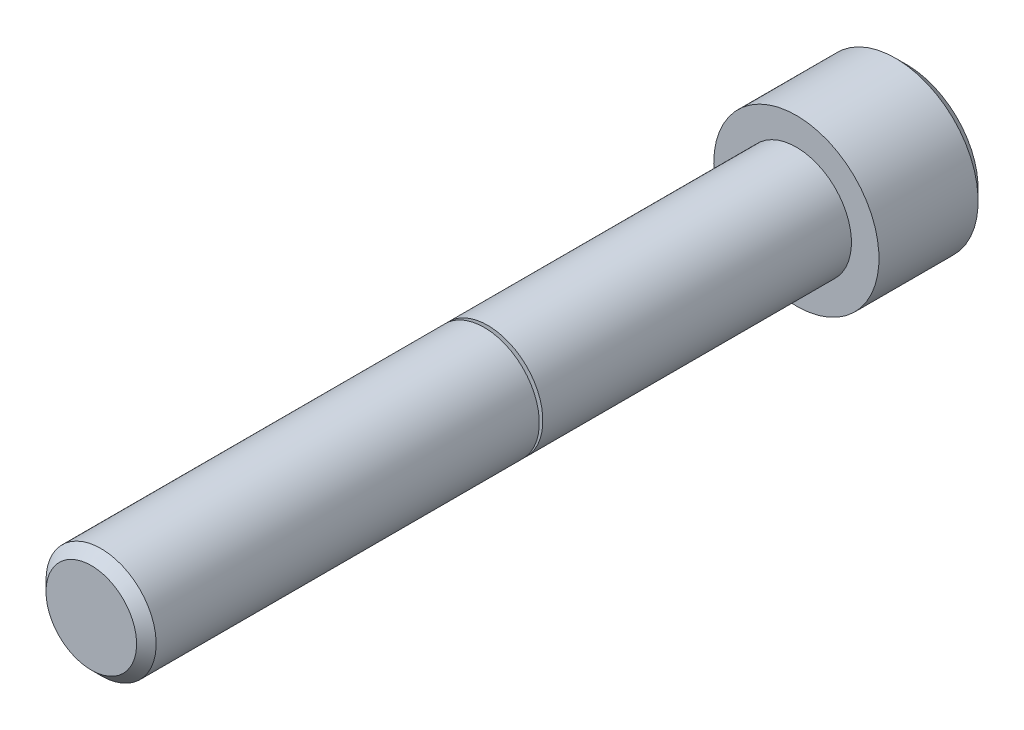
ISO-10303-21;
HEADER;
FILE_DESCRIPTION(('STEP AP214'),'2;1');
FILE_NAME('part.step','',(''),(''),'','','');
FILE_SCHEMA(('AUTOMOTIVE_DESIGN { 1 0 10303 214 1 1 1 1 }'));
ENDSEC;
DATA;
#1=APPLICATION_CONTEXT('core data for automotive mechanical design processes');
#2=APPLICATION_PROTOCOL_DEFINITION('international standard','automotive_design',2000,#1);
#3=PRODUCT_CONTEXT('',#1,'mechanical');
#4=PRODUCT('Part','Part','',(#3));
#5=PRODUCT_RELATED_PRODUCT_CATEGORY('part','',(#4));
#6=PRODUCT_DEFINITION_FORMATION('','',#4);
#7=PRODUCT_DEFINITION_CONTEXT('part definition',#1,'design');
#8=PRODUCT_DEFINITION('design','',#6,#7);
#9=PRODUCT_DEFINITION_SHAPE('','',#8);
#10=(LENGTH_UNIT() NAMED_UNIT(*) SI_UNIT(.MILLI.,.METRE.));
#11=(NAMED_UNIT(*) PLANE_ANGLE_UNIT() SI_UNIT($,.RADIAN.));
#12=(NAMED_UNIT(*) SI_UNIT($,.STERADIAN.) SOLID_ANGLE_UNIT());
#13=UNCERTAINTY_MEASURE_WITH_UNIT(LENGTH_MEASURE(1.E-05),#10,'distance_accuracy_value','');
#14=(GEOMETRIC_REPRESENTATION_CONTEXT(3) GLOBAL_UNCERTAINTY_ASSIGNED_CONTEXT((#13)) GLOBAL_UNIT_ASSIGNED_CONTEXT((#10,
#11,#12)) REPRESENTATION_CONTEXT('',''));
#15=CARTESIAN_POINT('',(0.,0.,0.));
#16=DIRECTION('',(0.,0.,1.));
#17=DIRECTION('',(1.,0.,0.));
#18=AXIS2_PLACEMENT_3D('',#15,#16,#17);
#19=CARTESIAN_POINT('',(0.,0.,-7.93749999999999));
#20=DIRECTION('',(0.,0.,1.));
#21=DIRECTION('',(1.,0.,0.));
#22=AXIS2_PLACEMENT_3D('',#19,#20,#21);
#23=PLANE('',#22);
#24=DIRECTION('',(-0.5,-0.866025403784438,0.));
#25=VECTOR('',#24,1.);
#26=CARTESIAN_POINT('',(3.66617420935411,0.,-7.93749999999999));
#27=LINE('',#26,#25);
#28=CARTESIAN_POINT('',(3.66617420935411,0.,-7.93749999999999));
#29=VERTEX_POINT('',#28);
#30=CARTESIAN_POINT('',(1.83308710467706,-3.17500000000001,-7.93749999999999));
#31=VERTEX_POINT('',#30);
#32=EDGE_CURVE('E145',#29,#31,#27,.T.);
#33=ORIENTED_EDGE('',*,*,#32,.F.);
#34=DIRECTION('',(0.499999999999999,-0.866025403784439,0.));
#35=VECTOR('',#34,1.);
#36=CARTESIAN_POINT('',(1.83308710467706,3.175,-7.93749999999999));
#37=LINE('',#36,#35);
#38=CARTESIAN_POINT('',(1.83308710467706,3.175,-7.93749999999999));
#39=VERTEX_POINT('',#38);
#40=EDGE_CURVE('E64',#39,#29,#37,.T.);
#41=ORIENTED_EDGE('',*,*,#40,.F.);
#42=DIRECTION('',(1.,0.,0.));
#43=VECTOR('',#42,1.);
#44=CARTESIAN_POINT('',(-1.83308710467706,3.175,-7.93749999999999));
#45=LINE('',#44,#43);
#46=CARTESIAN_POINT('',(-1.83308710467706,3.175,-7.93749999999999));
#47=VERTEX_POINT('',#46);
#48=EDGE_CURVE('E158',#47,#39,#45,.T.);
#49=ORIENTED_EDGE('',*,*,#48,.F.);
#50=DIRECTION('',(0.5,0.866025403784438,0.));
#51=VECTOR('',#50,1.);
#52=CARTESIAN_POINT('',(-3.66617420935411,0.,-7.93749999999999));
#53=LINE('',#52,#51);
#54=CARTESIAN_POINT('',(-3.66617420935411,0.,-7.93749999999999));
#55=VERTEX_POINT('',#54);
#56=EDGE_CURVE('E155',#55,#47,#53,.T.);
#57=ORIENTED_EDGE('',*,*,#56,.F.);
#58=DIRECTION('',(-0.5,0.866025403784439,0.));
#59=VECTOR('',#58,1.);
#60=CARTESIAN_POINT('',(-1.83308710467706,-3.17500000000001,-7.93749999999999));
#61=LINE('',#60,#59);
#62=CARTESIAN_POINT('',(-1.83308710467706,-3.17500000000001,-7.93749999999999));
#63=VERTEX_POINT('',#62);
#64=EDGE_CURVE('E112',#63,#55,#61,.T.);
#65=ORIENTED_EDGE('',*,*,#64,.F.);
#66=DIRECTION('',(-1.,0.,0.));
#67=VECTOR('',#66,1.);
#68=CARTESIAN_POINT('',(1.83308710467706,-3.17500000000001,-7.93749999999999));
#69=LINE('',#68,#67);
#70=EDGE_CURVE('E149',#31,#63,#69,.T.);
#71=ORIENTED_EDGE('',*,*,#70,.F.);
#72=EDGE_LOOP('',(#33,#41,#49,#57,#65,#71));
#73=FACE_BOUND('',#72,.T.);
#74=CARTESIAN_POINT('',(0.,0.,-7.93749999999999));
#75=DIRECTION('',(0.,0.,-1.));
#76=DIRECTION('',(-1.,0.,0.));
#77=AXIS2_PLACEMENT_3D('',#74,#75,#76);
#78=CIRCLE('',#77,5.15937500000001);
#79=CARTESIAN_POINT('',(-5.15937500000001,0.,-7.93749999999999));
#80=VERTEX_POINT('',#79);
#81=EDGE_CURVE('E164',#80,#80,#78,.T.);
#82=ORIENTED_EDGE('',*,*,#81,.T.);
#83=EDGE_LOOP('',(#82));
#84=FACE_BOUND('',#83,.T.);
#85=ADVANCED_FACE('F49',(#73,#84),#23,.F.);
#86=CARTESIAN_POINT('',(-3.26390000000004,0.,50.8));
#87=DIRECTION('',(0.,0.,-1.));
#88=DIRECTION('',(-1.,0.,0.));
#89=AXIS2_PLACEMENT_3D('',#86,#87,#88);
#90=PLANE('',#89);
#91=CARTESIAN_POINT('',(0.,0.,50.8));
#92=DIRECTION('',(0.,0.,-1.));
#93=DIRECTION('',(-1.,0.,0.));
#94=AXIS2_PLACEMENT_3D('',#91,#92,#93);
#95=CIRCLE('',#94,3.26390000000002);
#96=CARTESIAN_POINT('',(-3.26390000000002,0.,50.8));
#97=VERTEX_POINT('',#96);
#98=EDGE_CURVE('E11',#97,#97,#95,.T.);
#99=ORIENTED_EDGE('',*,*,#98,.F.);
#100=EDGE_LOOP('',(#99));
#101=FACE_BOUND('',#100,.T.);
#102=ADVANCED_FACE('F214',(#101),#90,.F.);
#103=CARTESIAN_POINT('',(0.,0.,50.8));
#104=DIRECTION('',(0.,0.,-1.));
#105=DIRECTION('',(-1.,0.,0.));
#106=AXIS2_PLACEMENT_3D('',#103,#104,#105);
#107=CONICAL_SURFACE('',#106,3.26390000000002,0.785398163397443);
#108=CARTESIAN_POINT('',(0.,0.,50.09515));
#109=DIRECTION('',(0.,0.,-1.));
#110=DIRECTION('',(-1.,0.,0.));
#111=AXIS2_PLACEMENT_3D('',#108,#109,#110);
#112=CIRCLE('',#111,3.96875000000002);
#113=CARTESIAN_POINT('',(-3.96875000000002,0.,50.09515));
#114=VERTEX_POINT('',#113);
#115=EDGE_CURVE('E57',#114,#114,#112,.T.);
#116=ORIENTED_EDGE('',*,*,#115,.F.);
#117=EDGE_LOOP('',(#116));
#118=FACE_BOUND('',#117,.T.);
#119=ORIENTED_EDGE('',*,*,#98,.T.);
#120=EDGE_LOOP('',(#119));
#121=FACE_BOUND('',#120,.T.);
#122=ADVANCED_FACE('F211',(#118,#121),#107,.T.);
#123=CARTESIAN_POINT('',(0.,0.,-10.585154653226));
#124=DIRECTION('',(0.,0.,-1.));
#125=DIRECTION('',(-1.,0.,0.));
#126=AXIS2_PLACEMENT_3D('',#123,#124,#125);
#127=CYLINDRICAL_SURFACE('',#126,3.96875000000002);
#128=CARTESIAN_POINT('',(0.,0.,22.4915444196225));
#129=DIRECTION('',(0.,0.,-1.));
#130=DIRECTION('',(-1.,0.,0.));
#131=AXIS2_PLACEMENT_3D('',#128,#129,#130);
#132=CIRCLE('',#131,3.96875000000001);
#133=CARTESIAN_POINT('',(-3.96875000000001,0.,22.4915444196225));
#134=VERTEX_POINT('',#133);
#135=EDGE_CURVE('E201',#134,#134,#132,.T.);
#136=ORIENTED_EDGE('',*,*,#135,.F.);
#137=EDGE_LOOP('',(#136));
#138=FACE_BOUND('',#137,.T.);
#139=ORIENTED_EDGE('',*,*,#115,.T.);
#140=EDGE_LOOP('',(#139));
#141=FACE_BOUND('',#140,.T.);
#142=ADVANCED_FACE('F209',(#138,#141),#127,.T.);
#143=CARTESIAN_POINT('',(0.,0.,22.4915444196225));
#144=DIRECTION('',(0.,0.,1.));
#145=DIRECTION('',(1.,0.,0.));
#146=AXIS2_PLACEMENT_3D('',#143,#144,#145);
#147=CONICAL_SURFACE('',#146,3.96875000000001,1.22173047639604);
#148=CARTESIAN_POINT('',(0.,0.,22.2737938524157));
#149=DIRECTION('',(0.,0.,-1.));
#150=DIRECTION('',(-1.,0.,0.));
#151=AXIS2_PLACEMENT_3D('',#148,#149,#150);
#152=CIRCLE('',#151,3.37048523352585);
#153=CARTESIAN_POINT('',(-3.37048523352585,0.,22.2737938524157));
#154=VERTEX_POINT('',#153);
#155=EDGE_CURVE('E197',#154,#154,#152,.T.);
#156=ORIENTED_EDGE('',*,*,#155,.F.);
#157=EDGE_LOOP('',(#156));
#158=FACE_BOUND('',#157,.T.);
#159=ORIENTED_EDGE('',*,*,#135,.T.);
#160=EDGE_LOOP('',(#159));
#161=FACE_BOUND('',#160,.T.);
#162=ADVANCED_FACE('F226',(#158,#161),#147,.T.);
#163=CARTESIAN_POINT('',(0.,0.,22.255));
#164=DIRECTION('',(0.,0.,-1.));
#165=DIRECTION('',(-1.,0.,0.));
#166=AXIS2_PLACEMENT_3D('',#163,#164,#165);
#167=TOROIDAL_SURFACE('',#166,3.37732563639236,0.0200000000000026);
#168=CARTESIAN_POINT('',(0.,0.,22.235));
#169=DIRECTION('',(0.,0.,-1.));
#170=DIRECTION('',(-1.,0.,0.));
#171=AXIS2_PLACEMENT_3D('',#168,#169,#170);
#172=CIRCLE('',#171,3.37732563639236);
#173=CARTESIAN_POINT('',(-3.37732563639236,0.,22.235));
#174=VERTEX_POINT('',#173);
#175=EDGE_CURVE('E193',#174,#174,#172,.T.);
#176=ORIENTED_EDGE('',*,*,#175,.F.);
#177=EDGE_LOOP('',(#176));
#178=FACE_BOUND('',#177,.T.);
#179=ORIENTED_EDGE('',*,*,#155,.T.);
#180=EDGE_LOOP('',(#179));
#181=FACE_BOUND('',#180,.T.);
#182=ADVANCED_FACE('F230',(#178,#181),#167,.F.);
#183=CARTESIAN_POINT('',(-3.96875000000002,0.,22.235));
#184=DIRECTION('',(0.,0.,-1.));
#185=DIRECTION('',(-1.,0.,0.));
#186=AXIS2_PLACEMENT_3D('',#183,#184,#185);
#187=PLANE('',#186);
#188=CARTESIAN_POINT('',(0.,0.,22.235));
#189=DIRECTION('',(0.,0.,-1.));
#190=DIRECTION('',(-1.,0.,0.));
#191=AXIS2_PLACEMENT_3D('',#188,#189,#190);
#192=CIRCLE('',#191,3.96875000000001);
#193=CARTESIAN_POINT('',(-3.96875000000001,0.,22.235));
#194=VERTEX_POINT('',#193);
#195=EDGE_CURVE('E189',#194,#194,#192,.T.);
#196=ORIENTED_EDGE('',*,*,#195,.F.);
#197=EDGE_LOOP('',(#196));
#198=FACE_BOUND('',#197,.T.);
#199=ORIENTED_EDGE('',*,*,#175,.T.);
#200=EDGE_LOOP('',(#199));
#201=FACE_BOUND('',#200,.T.);
#202=ADVANCED_FACE('F234',(#198,#201),#187,.F.);
#203=CARTESIAN_POINT('',(0.,0.,-10.585154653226));
#204=DIRECTION('',(0.,0.,-1.));
#205=DIRECTION('',(-1.,0.,0.));
#206=AXIS2_PLACEMENT_3D('',#203,#204,#205);
#207=CYLINDRICAL_SURFACE('',#206,3.96875000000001);
#208=CARTESIAN_POINT('',(0.,0.,0.));
#209=DIRECTION('',(0.,0.,-1.));
#210=DIRECTION('',(-1.,0.,0.));
#211=AXIS2_PLACEMENT_3D('',#208,#209,#210);
#212=CIRCLE('',#211,3.96875);
#213=CARTESIAN_POINT('',(-3.96875,0.,0.));
#214=VERTEX_POINT('',#213);
#215=EDGE_CURVE('E185',#214,#214,#212,.T.);
#216=ORIENTED_EDGE('',*,*,#215,.F.);
#217=EDGE_LOOP('',(#216));
#218=FACE_BOUND('',#217,.T.);
#219=ORIENTED_EDGE('',*,*,#195,.T.);
#220=EDGE_LOOP('',(#219));
#221=FACE_BOUND('',#220,.T.);
#222=ADVANCED_FACE('F238',(#218,#221),#207,.T.);
#223=CARTESIAN_POINT('',(-5.953125,0.,0.));
#224=DIRECTION('',(0.,0.,-1.));
#225=DIRECTION('',(-1.,0.,0.));
#226=AXIS2_PLACEMENT_3D('',#223,#224,#225);
#227=PLANE('',#226);
#228=CARTESIAN_POINT('',(0.,0.,0.));
#229=DIRECTION('',(0.,0.,-1.));
#230=DIRECTION('',(-1.,0.,0.));
#231=AXIS2_PLACEMENT_3D('',#228,#229,#230);
#232=CIRCLE('',#231,5.95312500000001);
#233=CARTESIAN_POINT('',(-5.95312500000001,0.,0.));
#234=VERTEX_POINT('',#233);
#235=EDGE_CURVE('E181',#234,#234,#232,.T.);
#236=ORIENTED_EDGE('',*,*,#235,.F.);
#237=EDGE_LOOP('',(#236));
#238=FACE_BOUND('',#237,.T.);
#239=ORIENTED_EDGE('',*,*,#215,.T.);
#240=EDGE_LOOP('',(#239));
#241=FACE_BOUND('',#240,.T.);
#242=ADVANCED_FACE('F242',(#238,#241),#227,.F.);
#243=CARTESIAN_POINT('',(0.,0.,-10.585154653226));
#244=DIRECTION('',(0.,0.,-1.));
#245=DIRECTION('',(-1.,0.,0.));
#246=AXIS2_PLACEMENT_3D('',#243,#244,#245);
#247=CYLINDRICAL_SURFACE('',#246,5.953125);
#248=CARTESIAN_POINT('',(0.,0.,-7.14375));
#249=DIRECTION('',(0.,0.,-1.));
#250=DIRECTION('',(-1.,0.,0.));
#251=AXIS2_PLACEMENT_3D('',#248,#249,#250);
#252=CIRCLE('',#251,5.953125);
#253=CARTESIAN_POINT('',(-5.953125,0.,-7.14375));
#254=VERTEX_POINT('',#253);
#255=EDGE_CURVE('E177',#254,#254,#252,.T.);
#256=ORIENTED_EDGE('',*,*,#255,.F.);
#257=EDGE_LOOP('',(#256));
#258=FACE_BOUND('',#257,.T.);
#259=ORIENTED_EDGE('',*,*,#235,.T.);
#260=EDGE_LOOP('',(#259));
#261=FACE_BOUND('',#260,.T.);
#262=ADVANCED_FACE('F246',(#258,#261),#247,.T.);
#263=CARTESIAN_POINT('',(0.,0.,-7.14375));
#264=DIRECTION('',(0.,0.,1.));
#265=DIRECTION('',(1.,0.,0.));
#266=AXIS2_PLACEMENT_3D('',#263,#264,#265);
#267=CONICAL_SURFACE('',#266,5.953125,0.785398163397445);
#268=ORIENTED_EDGE('',*,*,#81,.F.);
#269=EDGE_LOOP('',(#268));
#270=FACE_BOUND('',#269,.T.);
#271=ORIENTED_EDGE('',*,*,#255,.T.);
#272=EDGE_LOOP('',(#271));
#273=FACE_BOUND('',#272,.T.);
#274=ADVANCED_FACE('F250',(#270,#273),#267,.T.);
#275=CARTESIAN_POINT('',(1.83308710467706,3.175,-3.96875));
#276=DIRECTION('',(0.866025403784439,0.5,0.));
#277=DIRECTION('',(-0.5,0.866025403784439,0.));
#278=AXIS2_PLACEMENT_3D('',#275,#276,#277);
#279=PLANE('',#278);
#280=ORIENTED_EDGE('',*,*,#40,.T.);
#281=DIRECTION('',(0.,0.,-1.));
#282=VECTOR('',#281,1.);
#283=CARTESIAN_POINT('',(3.66617420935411,0.,-3.96875));
#284=LINE('',#283,#282);
#285=CARTESIAN_POINT('',(3.66617420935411,0.,-3.96875));
#286=VERTEX_POINT('',#285);
#287=EDGE_CURVE('E94',#286,#29,#284,.T.);
#288=ORIENTED_EDGE('',*,*,#287,.F.);
#289=DIRECTION('',(0.499999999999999,-0.866025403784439,0.));
#290=VECTOR('',#289,1.);
#291=CARTESIAN_POINT('',(1.83308710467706,3.175,-3.96875));
#292=LINE('',#291,#290);
#293=CARTESIAN_POINT('',(1.83308710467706,3.175,-3.96875));
#294=VERTEX_POINT('',#293);
#295=EDGE_CURVE('E161',#294,#286,#292,.T.);
#296=ORIENTED_EDGE('',*,*,#295,.F.);
#297=DIRECTION('',(0.,0.,-1.));
#298=VECTOR('',#297,1.);
#299=CARTESIAN_POINT('',(1.83308710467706,3.175,-3.96875));
#300=LINE('',#299,#298);
#301=EDGE_CURVE('E72',#294,#39,#300,.T.);
#302=ORIENTED_EDGE('',*,*,#301,.T.);
#303=EDGE_LOOP('',(#280,#288,#296,#302));
#304=FACE_BOUND('',#303,.T.);
#305=ADVANCED_FACE('F254',(#304),#279,.F.);
#306=CARTESIAN_POINT('',(-1.83308710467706,3.175,-3.96875));
#307=DIRECTION('',(0.,1.,0.));
#308=DIRECTION('',(-1.,0.,0.));
#309=AXIS2_PLACEMENT_3D('',#306,#307,#308);
#310=PLANE('',#309);
#311=ORIENTED_EDGE('',*,*,#48,.T.);
#312=ORIENTED_EDGE('',*,*,#301,.F.);
#313=DIRECTION('',(1.,0.,0.));
#314=VECTOR('',#313,1.);
#315=CARTESIAN_POINT('',(-1.83308710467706,3.175,-3.96875));
#316=LINE('',#315,#314);
#317=CARTESIAN_POINT('',(-1.83308710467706,3.175,-3.96875));
#318=VERTEX_POINT('',#317);
#319=EDGE_CURVE('E126',#318,#294,#316,.T.);
#320=ORIENTED_EDGE('',*,*,#319,.F.);
#321=DIRECTION('',(0.,0.,-1.));
#322=VECTOR('',#321,1.);
#323=CARTESIAN_POINT('',(-1.83308710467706,3.175,-3.96875));
#324=LINE('',#323,#322);
#325=EDGE_CURVE('E117',#318,#47,#324,.T.);
#326=ORIENTED_EDGE('',*,*,#325,.T.);
#327=EDGE_LOOP('',(#311,#312,#320,#326));
#328=FACE_BOUND('',#327,.T.);
#329=ADVANCED_FACE('F258',(#328),#310,.F.);
#330=CARTESIAN_POINT('',(-3.66617420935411,0.,-3.96875));
#331=DIRECTION('',(-0.866025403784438,0.5,0.));
#332=DIRECTION('',(-0.5,-0.866025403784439,0.));
#333=AXIS2_PLACEMENT_3D('',#330,#331,#332);
#334=PLANE('',#333);
#335=ORIENTED_EDGE('',*,*,#56,.T.);
#336=ORIENTED_EDGE('',*,*,#325,.F.);
#337=DIRECTION('',(0.5,0.866025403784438,0.));
#338=VECTOR('',#337,1.);
#339=CARTESIAN_POINT('',(-3.66617420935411,0.,-3.96875));
#340=LINE('',#339,#338);
#341=CARTESIAN_POINT('',(-3.66617420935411,0.,-3.96875));
#342=VERTEX_POINT('',#341);
#343=EDGE_CURVE('E121',#342,#318,#340,.T.);
#344=ORIENTED_EDGE('',*,*,#343,.F.);
#345=DIRECTION('',(0.,0.,-1.));
#346=VECTOR('',#345,1.);
#347=CARTESIAN_POINT('',(-3.66617420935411,0.,-3.96875));
#348=LINE('',#347,#346);
#349=EDGE_CURVE('E105',#342,#55,#348,.T.);
#350=ORIENTED_EDGE('',*,*,#349,.T.);
#351=EDGE_LOOP('',(#335,#336,#344,#350));
#352=FACE_BOUND('',#351,.T.);
#353=ADVANCED_FACE('F122',(#352),#334,.F.);
#354=CARTESIAN_POINT('',(-1.83308710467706,-3.17500000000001,-3.96875));
#355=DIRECTION('',(-0.866025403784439,-0.5,0.));
#356=DIRECTION('',(0.5,-0.866025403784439,0.));
#357=AXIS2_PLACEMENT_3D('',#354,#355,#356);
#358=PLANE('',#357);
#359=ORIENTED_EDGE('',*,*,#64,.T.);
#360=ORIENTED_EDGE('',*,*,#349,.F.);
#361=DIRECTION('',(-0.5,0.866025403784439,0.));
#362=VECTOR('',#361,1.);
#363=CARTESIAN_POINT('',(-1.83308710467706,-3.17500000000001,-3.96875));
#364=LINE('',#363,#362);
#365=CARTESIAN_POINT('',(-1.83308710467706,-3.17500000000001,-3.96875));
#366=VERTEX_POINT('',#365);
#367=EDGE_CURVE('E109',#366,#342,#364,.T.);
#368=ORIENTED_EDGE('',*,*,#367,.F.);
#369=DIRECTION('',(0.,0.,-1.));
#370=VECTOR('',#369,1.);
#371=CARTESIAN_POINT('',(-1.83308710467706,-3.17500000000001,-3.96875));
#372=LINE('',#371,#370);
#373=EDGE_CURVE('E118',#366,#63,#372,.T.);
#374=ORIENTED_EDGE('',*,*,#373,.T.);
#375=EDGE_LOOP('',(#359,#360,#368,#374));
#376=FACE_BOUND('',#375,.T.);
#377=ADVANCED_FACE('F107',(#376),#358,.F.);
#378=CARTESIAN_POINT('',(1.83308710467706,-3.17500000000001,-3.96875));
#379=DIRECTION('',(0.,-1.,0.));
#380=DIRECTION('',(0.,0.,-1.));
#381=AXIS2_PLACEMENT_3D('',#378,#379,#380);
#382=PLANE('',#381);
#383=ORIENTED_EDGE('',*,*,#70,.T.);
#384=ORIENTED_EDGE('',*,*,#373,.F.);
#385=DIRECTION('',(-1.,0.,0.));
#386=VECTOR('',#385,1.);
#387=CARTESIAN_POINT('',(1.83308710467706,-3.17500000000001,-3.96875));
#388=LINE('',#387,#386);
#389=CARTESIAN_POINT('',(1.83308710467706,-3.17500000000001,-3.96875));
#390=VERTEX_POINT('',#389);
#391=EDGE_CURVE('E132',#390,#366,#388,.T.);
#392=ORIENTED_EDGE('',*,*,#391,.F.);
#393=DIRECTION('',(0.,0.,-1.));
#394=VECTOR('',#393,1.);
#395=CARTESIAN_POINT('',(1.83308710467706,-3.17500000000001,-3.96875));
#396=LINE('',#395,#394);
#397=EDGE_CURVE('E169',#390,#31,#396,.T.);
#398=ORIENTED_EDGE('',*,*,#397,.T.);
#399=EDGE_LOOP('',(#383,#384,#392,#398));
#400=FACE_BOUND('',#399,.T.);
#401=ADVANCED_FACE('F262',(#400),#382,.F.);
#402=CARTESIAN_POINT('',(3.66617420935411,0.,-3.96875));
#403=DIRECTION('',(0.866025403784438,-0.5,0.));
#404=DIRECTION('',(0.5,0.866025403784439,0.));
#405=AXIS2_PLACEMENT_3D('',#402,#403,#404);
#406=PLANE('',#405);
#407=ORIENTED_EDGE('',*,*,#32,.T.);
#408=ORIENTED_EDGE('',*,*,#397,.F.);
#409=DIRECTION('',(-0.5,-0.866025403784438,0.));
#410=VECTOR('',#409,1.);
#411=CARTESIAN_POINT('',(3.66617420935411,0.,-3.96875));
#412=LINE('',#411,#410);
#413=EDGE_CURVE('E137',#286,#390,#412,.T.);
#414=ORIENTED_EDGE('',*,*,#413,.F.);
#415=ORIENTED_EDGE('',*,*,#287,.T.);
#416=EDGE_LOOP('',(#407,#408,#414,#415));
#417=FACE_BOUND('',#416,.T.);
#418=ADVANCED_FACE('F259',(#417),#406,.F.);
#419=CARTESIAN_POINT('',(1.83308710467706,3.175,-3.96875));
#420=DIRECTION('',(0.,0.,1.));
#421=DIRECTION('',(1.,0.,0.));
#422=AXIS2_PLACEMENT_3D('',#419,#420,#421);
#423=PLANE('',#422);
#424=ORIENTED_EDGE('',*,*,#295,.T.);
#425=ORIENTED_EDGE('',*,*,#413,.T.);
#426=ORIENTED_EDGE('',*,*,#391,.T.);
#427=ORIENTED_EDGE('',*,*,#367,.T.);
#428=ORIENTED_EDGE('',*,*,#343,.T.);
#429=ORIENTED_EDGE('',*,*,#319,.T.);
#430=EDGE_LOOP('',(#424,#425,#426,#427,#428,#429));
#431=FACE_BOUND('',#430,.T.);
#432=ADVANCED_FACE('F129',(#431),#423,.F.);
#433=CLOSED_SHELL('',(#85,#102,#122,#142,#162,#182,#202,#222,#242,#262,#274,#305,#329,#353,#377,
#401,#418,#432));
#434=MANIFOLD_SOLID_BREP('B2',#433);
#435=ADVANCED_BREP_SHAPE_REPRESENTATION('',(#18,#434),#14);
#436=SHAPE_DEFINITION_REPRESENTATION(#9,#435);
ENDSEC;
END-ISO-10303-21;
